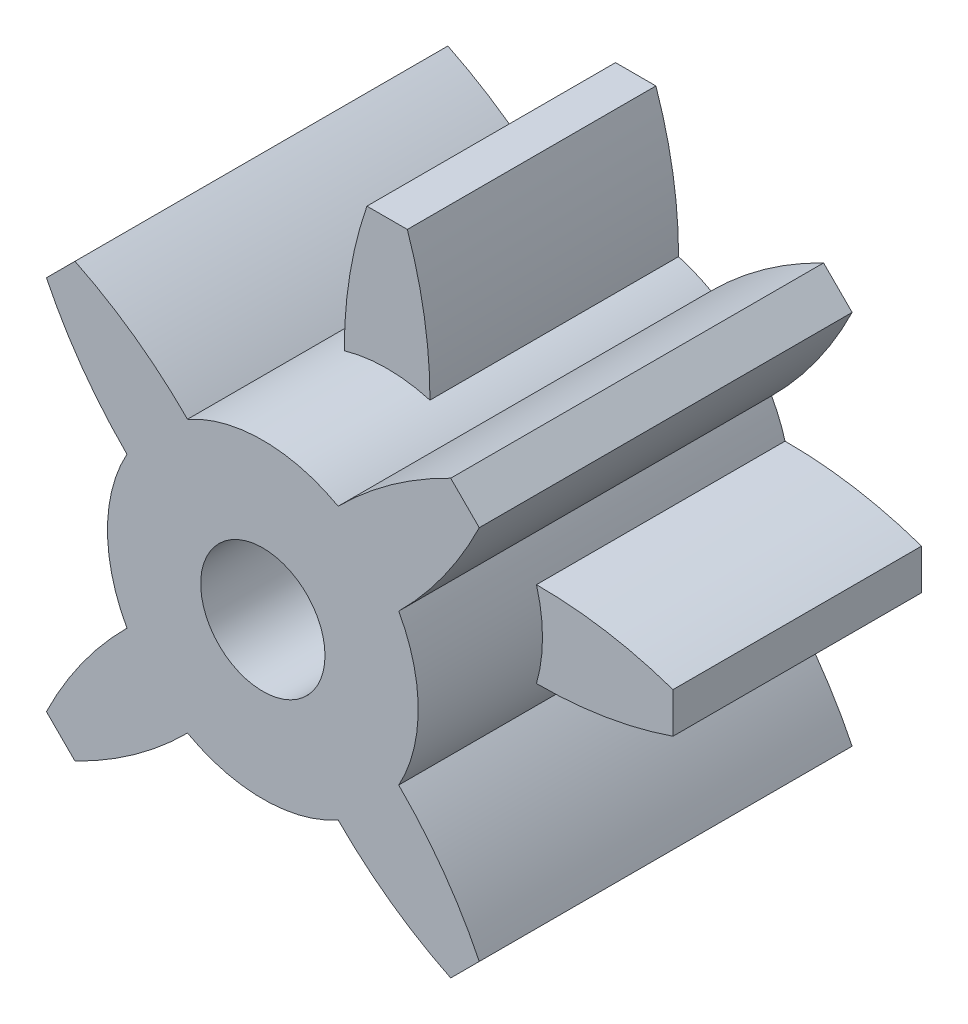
ISO-10303-21;
HEADER;
FILE_DESCRIPTION(('STEP AP214'),'2;1');
FILE_NAME('part.step','',(''),(''),'','','');
FILE_SCHEMA(('AUTOMOTIVE_DESIGN { 1 0 10303 214 1 1 1 1 }'));
ENDSEC;
DATA;
#1=APPLICATION_CONTEXT('core data for automotive mechanical design processes');
#2=APPLICATION_PROTOCOL_DEFINITION('international standard','automotive_design',2000,#1);
#3=PRODUCT_CONTEXT('',#1,'mechanical');
#4=PRODUCT('Part','Part','',(#3));
#5=PRODUCT_RELATED_PRODUCT_CATEGORY('part','',(#4));
#6=PRODUCT_DEFINITION_FORMATION('','',#4);
#7=PRODUCT_DEFINITION_CONTEXT('part definition',#1,'design');
#8=PRODUCT_DEFINITION('design','',#6,#7);
#9=PRODUCT_DEFINITION_SHAPE('','',#8);
#10=(LENGTH_UNIT() NAMED_UNIT(*) SI_UNIT(.MILLI.,.METRE.));
#11=(NAMED_UNIT(*) PLANE_ANGLE_UNIT() SI_UNIT($,.RADIAN.));
#12=(NAMED_UNIT(*) SI_UNIT($,.STERADIAN.) SOLID_ANGLE_UNIT());
#13=UNCERTAINTY_MEASURE_WITH_UNIT(LENGTH_MEASURE(1.E-05),#10,'distance_accuracy_value','');
#14=(GEOMETRIC_REPRESENTATION_CONTEXT(3) GLOBAL_UNCERTAINTY_ASSIGNED_CONTEXT((#13)) GLOBAL_UNIT_ASSIGNED_CONTEXT((#10,
#11,#12)) REPRESENTATION_CONTEXT('',''));
#15=CARTESIAN_POINT('',(0.,0.,0.));
#16=DIRECTION('',(0.,0.,1.));
#17=DIRECTION('',(1.,0.,0.));
#18=AXIS2_PLACEMENT_3D('',#15,#16,#17);
#19=CARTESIAN_POINT('',(-29.8672178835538,75.1376777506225,30.));
#20=DIRECTION('',(0.,0.,-1.));
#21=DIRECTION('',(-1.,0.,0.));
#22=AXIS2_PLACEMENT_3D('',#19,#20,#21);
#23=CYLINDRICAL_SURFACE('',#22,33.3129078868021);
#24=CARTESIAN_POINT('',(-29.8672178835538,75.1376777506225,20.));
#25=DIRECTION('',(0.,0.,1.));
#26=DIRECTION('',(1.,0.,0.));
#27=AXIS2_PLACEMENT_3D('',#24,#25,#26);
#28=CIRCLE('',#27,33.3129078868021);
#29=CARTESIAN_POINT('',(3.44546694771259,75.0157711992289,20.));
#30=VERTEX_POINT('',#29);
#31=CARTESIAN_POINT('',(1.62500000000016,86.,20.));
#32=VERTEX_POINT('',#31);
#33=EDGE_CURVE('E445',#30,#32,#28,.T.);
#34=ORIENTED_EDGE('',*,*,#33,.F.);
#35=DIRECTION('',(0.,0.,-1.));
#36=VECTOR('',#35,1.);
#37=CARTESIAN_POINT('',(3.44546694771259,75.015771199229,30.));
#38=LINE('',#37,#36);
#39=CARTESIAN_POINT('',(3.44546694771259,75.015771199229,0.));
#40=VERTEX_POINT('',#39);
#41=EDGE_CURVE('E376',#30,#40,#38,.T.);
#42=ORIENTED_EDGE('',*,*,#41,.T.);
#43=CARTESIAN_POINT('',(-29.8672178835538,75.1376777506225,0.));
#44=DIRECTION('',(0.,0.,1.));
#45=DIRECTION('',(1.,0.,0.));
#46=AXIS2_PLACEMENT_3D('',#43,#44,#45);
#47=CIRCLE('',#46,33.3129078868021);
#48=CARTESIAN_POINT('',(1.62500000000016,86.,0.));
#49=VERTEX_POINT('',#48);
#50=EDGE_CURVE('E261',#40,#49,#47,.T.);
#51=ORIENTED_EDGE('',*,*,#50,.T.);
#52=DIRECTION('',(0.,0.,-1.));
#53=VECTOR('',#52,1.);
#54=CARTESIAN_POINT('',(1.62500000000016,86.,30.));
#55=LINE('',#54,#53);
#56=EDGE_CURVE('E374',#32,#49,#55,.T.);
#57=ORIENTED_EDGE('',*,*,#56,.F.);
#58=EDGE_LOOP('',(#34,#42,#51,#57));
#59=FACE_BOUND('',#58,.T.);
#60=ADVANCED_FACE('F38',(#59),#23,.T.);
#61=CARTESIAN_POINT('',(7.34455231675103E-13,86.,30.));
#62=DIRECTION('',(0.,-1.,0.));
#63=DIRECTION('',(1.,0.,0.));
#64=AXIS2_PLACEMENT_3D('',#61,#62,#63);
#65=PLANE('',#64);
#66=DIRECTION('',(-1.,0.,0.));
#67=VECTOR('',#66,1.);
#68=CARTESIAN_POINT('',(7.34455231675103E-13,86.,20.));
#69=LINE('',#68,#67);
#70=CARTESIAN_POINT('',(-1.62499999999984,86.,20.));
#71=VERTEX_POINT('',#70);
#72=EDGE_CURVE('E442',#32,#71,#69,.T.);
#73=ORIENTED_EDGE('',*,*,#72,.F.);
#74=ORIENTED_EDGE('',*,*,#56,.T.);
#75=DIRECTION('',(-1.,0.,0.));
#76=VECTOR('',#75,1.);
#77=CARTESIAN_POINT('',(7.34455231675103E-13,86.,0.));
#78=LINE('',#77,#76);
#79=CARTESIAN_POINT('',(-1.62499999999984,86.,0.));
#80=VERTEX_POINT('',#79);
#81=EDGE_CURVE('E264',#49,#80,#78,.T.);
#82=ORIENTED_EDGE('',*,*,#81,.T.);
#83=DIRECTION('',(0.,0.,-1.));
#84=VECTOR('',#83,1.);
#85=CARTESIAN_POINT('',(-1.62499999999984,86.,30.));
#86=LINE('',#85,#84);
#87=EDGE_CURVE('E372',#71,#80,#86,.T.);
#88=ORIENTED_EDGE('',*,*,#87,.F.);
#89=EDGE_LOOP('',(#73,#74,#82,#88));
#90=FACE_BOUND('',#89,.T.);
#91=ADVANCED_FACE('F564',(#90),#65,.F.);
#92=CARTESIAN_POINT('',(29.867217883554,75.137677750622,30.));
#93=DIRECTION('',(0.,0.,-1.));
#94=DIRECTION('',(-1.,0.,0.));
#95=AXIS2_PLACEMENT_3D('',#92,#93,#94);
#96=CYLINDRICAL_SURFACE('',#95,33.3129078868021);
#97=DIRECTION('',(0.,0.,-1.));
#98=VECTOR('',#97,1.);
#99=CARTESIAN_POINT('',(-3.44546694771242,75.015771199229,30.));
#100=LINE('',#99,#98);
#101=CARTESIAN_POINT('',(-3.44546694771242,75.015771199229,20.));
#102=VERTEX_POINT('',#101);
#103=CARTESIAN_POINT('',(-3.44546694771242,75.015771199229,0.));
#104=VERTEX_POINT('',#103);
#105=EDGE_CURVE('E370',#102,#104,#100,.T.);
#106=ORIENTED_EDGE('',*,*,#105,.F.);
#107=CARTESIAN_POINT('',(29.867217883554,75.137677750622,20.));
#108=DIRECTION('',(0.,0.,1.));
#109=DIRECTION('',(1.,0.,0.));
#110=AXIS2_PLACEMENT_3D('',#107,#108,#109);
#111=CIRCLE('',#110,33.3129078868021);
#112=EDGE_CURVE('E438',#71,#102,#111,.T.);
#113=ORIENTED_EDGE('',*,*,#112,.F.);
#114=ORIENTED_EDGE('',*,*,#87,.T.);
#115=CARTESIAN_POINT('',(29.867217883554,75.137677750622,0.));
#116=DIRECTION('',(0.,0.,1.));
#117=DIRECTION('',(1.,0.,0.));
#118=AXIS2_PLACEMENT_3D('',#115,#116,#117);
#119=CIRCLE('',#118,33.3129078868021);
#120=EDGE_CURVE('E267',#104,#80,#119,.F.);
#121=ORIENTED_EDGE('',*,*,#120,.F.);
#122=EDGE_LOOP('',(#106,#113,#114,#121));
#123=FACE_BOUND('',#122,.T.);
#124=ADVANCED_FACE('F570',(#123),#96,.T.);
#125=CARTESIAN_POINT('',(-12.1376777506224,33.1327821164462,30.));
#126=DIRECTION('',(0.,0.,-1.));
#127=DIRECTION('',(-1.,0.,0.));
#128=AXIS2_PLACEMENT_3D('',#125,#126,#127);
#129=CYLINDRICAL_SURFACE('',#128,33.3129078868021);
#130=CARTESIAN_POINT('',(-12.1376777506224,33.1327821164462,20.));
#131=DIRECTION('',(0.,0.,1.));
#132=DIRECTION('',(1.,0.,0.));
#133=AXIS2_PLACEMENT_3D('',#130,#131,#132);
#134=CIRCLE('',#133,33.3129078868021);
#135=CARTESIAN_POINT('',(-12.015771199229,66.4454669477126,20.));
#136=VERTEX_POINT('',#135);
#137=CARTESIAN_POINT('',(-23.,64.6250000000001,20.));
#138=VERTEX_POINT('',#137);
#139=EDGE_CURVE('E466',#136,#138,#134,.T.);
#140=ORIENTED_EDGE('',*,*,#139,.F.);
#141=DIRECTION('',(0.,0.,-1.));
#142=VECTOR('',#141,1.);
#143=CARTESIAN_POINT('',(-12.015771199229,66.4454669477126,30.));
#144=LINE('',#143,#142);
#145=CARTESIAN_POINT('',(-12.015771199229,66.4454669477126,0.));
#146=VERTEX_POINT('',#145);
#147=EDGE_CURVE('E358',#136,#146,#144,.T.);
#148=ORIENTED_EDGE('',*,*,#147,.T.);
#149=CARTESIAN_POINT('',(-12.1376777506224,33.1327821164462,0.));
#150=DIRECTION('',(0.,0.,1.));
#151=DIRECTION('',(1.,0.,0.));
#152=AXIS2_PLACEMENT_3D('',#149,#150,#151);
#153=CIRCLE('',#152,33.3129078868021);
#154=CARTESIAN_POINT('',(-23.,64.6250000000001,0.));
#155=VERTEX_POINT('',#154);
#156=EDGE_CURVE('E280',#146,#155,#153,.T.);
#157=ORIENTED_EDGE('',*,*,#156,.T.);
#158=DIRECTION('',(0.,0.,-1.));
#159=VECTOR('',#158,1.);
#160=CARTESIAN_POINT('',(-23.,64.6250000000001,30.));
#161=LINE('',#160,#159);
#162=EDGE_CURVE('E356',#138,#155,#161,.T.);
#163=ORIENTED_EDGE('',*,*,#162,.F.);
#164=EDGE_LOOP('',(#140,#148,#157,#163));
#165=FACE_BOUND('',#164,.T.);
#166=ADVANCED_FACE('F628',(#165),#129,.T.);
#167=CARTESIAN_POINT('',(-23.0000000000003,0.,30.));
#168=DIRECTION('',(1.,0.,0.));
#169=DIRECTION('',(0.,1.,0.));
#170=AXIS2_PLACEMENT_3D('',#167,#168,#169);
#171=PLANE('',#170);
#172=DIRECTION('',(0.,-1.,0.));
#173=VECTOR('',#172,1.);
#174=CARTESIAN_POINT('',(-23.0000000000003,0.,20.));
#175=LINE('',#174,#173);
#176=CARTESIAN_POINT('',(-23.,61.3750000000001,20.));
#177=VERTEX_POINT('',#176);
#178=EDGE_CURVE('E463',#138,#177,#175,.T.);
#179=ORIENTED_EDGE('',*,*,#178,.F.);
#180=ORIENTED_EDGE('',*,*,#162,.T.);
#181=DIRECTION('',(0.,-1.,0.));
#182=VECTOR('',#181,1.);
#183=CARTESIAN_POINT('',(-23.0000000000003,0.,0.));
#184=LINE('',#183,#182);
#185=CARTESIAN_POINT('',(-23.,61.3750000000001,0.));
#186=VERTEX_POINT('',#185);
#187=EDGE_CURVE('E283',#155,#186,#184,.T.);
#188=ORIENTED_EDGE('',*,*,#187,.T.);
#189=DIRECTION('',(0.,0.,-1.));
#190=VECTOR('',#189,1.);
#191=CARTESIAN_POINT('',(-23.,61.3750000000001,30.));
#192=LINE('',#191,#190);
#193=EDGE_CURVE('E354',#177,#186,#192,.T.);
#194=ORIENTED_EDGE('',*,*,#193,.F.);
#195=EDGE_LOOP('',(#179,#180,#188,#194));
#196=FACE_BOUND('',#195,.T.);
#197=ADVANCED_FACE('F625',(#196),#171,.F.);
#198=CARTESIAN_POINT('',(-12.1376777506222,92.8672178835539,30.));
#199=DIRECTION('',(0.,0.,-1.));
#200=DIRECTION('',(-1.,0.,0.));
#201=AXIS2_PLACEMENT_3D('',#198,#199,#200);
#202=CYLINDRICAL_SURFACE('',#201,33.312907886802);
#203=DIRECTION('',(0.,0.,-1.));
#204=VECTOR('',#203,1.);
#205=CARTESIAN_POINT('',(-12.015771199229,59.5545330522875,30.));
#206=LINE('',#205,#204);
#207=CARTESIAN_POINT('',(-12.015771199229,59.5545330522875,20.));
#208=VERTEX_POINT('',#207);
#209=CARTESIAN_POINT('',(-12.015771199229,59.5545330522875,0.));
#210=VERTEX_POINT('',#209);
#211=EDGE_CURVE('E352',#208,#210,#206,.T.);
#212=ORIENTED_EDGE('',*,*,#211,.F.);
#213=CARTESIAN_POINT('',(-12.1376777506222,92.8672178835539,20.));
#214=DIRECTION('',(0.,0.,1.));
#215=DIRECTION('',(1.,0.,0.));
#216=AXIS2_PLACEMENT_3D('',#213,#214,#215);
#217=CIRCLE('',#216,33.312907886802);
#218=EDGE_CURVE('E249',#177,#208,#217,.T.);
#219=ORIENTED_EDGE('',*,*,#218,.F.);
#220=ORIENTED_EDGE('',*,*,#193,.T.);
#221=CARTESIAN_POINT('',(-12.1376777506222,92.8672178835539,0.));
#222=DIRECTION('',(0.,0.,1.));
#223=DIRECTION('',(1.,0.,0.));
#224=AXIS2_PLACEMENT_3D('',#221,#222,#223);
#225=CIRCLE('',#224,33.312907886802);
#226=EDGE_CURVE('E286',#210,#186,#225,.F.);
#227=ORIENTED_EDGE('',*,*,#226,.F.);
#228=EDGE_LOOP('',(#212,#219,#220,#227));
#229=FACE_BOUND('',#228,.T.);
#230=ADVANCED_FACE('F488',(#229),#202,.T.);
#231=CARTESIAN_POINT('',(29.8672178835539,50.8623222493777,30.));
#232=DIRECTION('',(0.,0.,-1.));
#233=DIRECTION('',(-1.,0.,0.));
#234=AXIS2_PLACEMENT_3D('',#231,#232,#233);
#235=CYLINDRICAL_SURFACE('',#234,33.3129078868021);
#236=CARTESIAN_POINT('',(29.8672178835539,50.8623222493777,20.));
#237=DIRECTION('',(0.,0.,1.));
#238=DIRECTION('',(1.,0.,0.));
#239=AXIS2_PLACEMENT_3D('',#236,#237,#238);
#240=CIRCLE('',#239,33.3129078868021);
#241=CARTESIAN_POINT('',(-3.4454669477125,50.984228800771,20.));
#242=VERTEX_POINT('',#241);
#243=CARTESIAN_POINT('',(-1.625,40.,20.));
#244=VERTEX_POINT('',#243);
#245=EDGE_CURVE('E432',#242,#244,#240,.T.);
#246=ORIENTED_EDGE('',*,*,#245,.F.);
#247=DIRECTION('',(0.,0.,-1.));
#248=VECTOR('',#247,1.);
#249=CARTESIAN_POINT('',(-3.44546694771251,50.984228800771,30.));
#250=LINE('',#249,#248);
#251=CARTESIAN_POINT('',(-3.44546694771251,50.984228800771,0.));
#252=VERTEX_POINT('',#251);
#253=EDGE_CURVE('E340',#242,#252,#250,.T.);
#254=ORIENTED_EDGE('',*,*,#253,.T.);
#255=CARTESIAN_POINT('',(29.8672178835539,50.8623222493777,0.));
#256=DIRECTION('',(0.,0.,1.));
#257=DIRECTION('',(1.,0.,0.));
#258=AXIS2_PLACEMENT_3D('',#255,#256,#257);
#259=CIRCLE('',#258,33.3129078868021);
#260=CARTESIAN_POINT('',(-1.625,40.,0.));
#261=VERTEX_POINT('',#260);
#262=EDGE_CURVE('E299',#252,#261,#259,.T.);
#263=ORIENTED_EDGE('',*,*,#262,.T.);
#264=DIRECTION('',(0.,0.,-1.));
#265=VECTOR('',#264,1.);
#266=CARTESIAN_POINT('',(-1.625,40.,30.));
#267=LINE('',#266,#265);
#268=EDGE_CURVE('E338',#244,#261,#267,.T.);
#269=ORIENTED_EDGE('',*,*,#268,.F.);
#270=EDGE_LOOP('',(#246,#254,#263,#269));
#271=FACE_BOUND('',#270,.T.);
#272=ADVANCED_FACE('F604',(#271),#235,.T.);
#273=CARTESIAN_POINT('',(0.,40.,30.));
#274=DIRECTION('',(0.,1.,0.));
#275=DIRECTION('',(0.,0.,1.));
#276=AXIS2_PLACEMENT_3D('',#273,#274,#275);
#277=PLANE('',#276);
#278=DIRECTION('',(1.,0.,0.));
#279=VECTOR('',#278,1.);
#280=CARTESIAN_POINT('',(0.,40.,20.));
#281=LINE('',#280,#279);
#282=CARTESIAN_POINT('',(1.62500000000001,40.,20.));
#283=VERTEX_POINT('',#282);
#284=EDGE_CURVE('E429',#244,#283,#281,.T.);
#285=ORIENTED_EDGE('',*,*,#284,.F.);
#286=ORIENTED_EDGE('',*,*,#268,.T.);
#287=DIRECTION('',(1.,0.,0.));
#288=VECTOR('',#287,1.);
#289=CARTESIAN_POINT('',(0.,40.,0.));
#290=LINE('',#289,#288);
#291=CARTESIAN_POINT('',(1.625,40.,0.));
#292=VERTEX_POINT('',#291);
#293=EDGE_CURVE('E302',#261,#292,#290,.T.);
#294=ORIENTED_EDGE('',*,*,#293,.T.);
#295=DIRECTION('',(0.,0.,-1.));
#296=VECTOR('',#295,1.);
#297=CARTESIAN_POINT('',(1.625,40.,30.));
#298=LINE('',#297,#296);
#299=EDGE_CURVE('E336',#283,#292,#298,.T.);
#300=ORIENTED_EDGE('',*,*,#299,.F.);
#301=EDGE_LOOP('',(#285,#286,#294,#300));
#302=FACE_BOUND('',#301,.T.);
#303=ADVANCED_FACE('F599',(#302),#277,.F.);
#304=CARTESIAN_POINT('',(-29.8672178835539,50.8623222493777,30.));
#305=DIRECTION('',(0.,0.,-1.));
#306=DIRECTION('',(-1.,0.,0.));
#307=AXIS2_PLACEMENT_3D('',#304,#305,#306);
#308=CYLINDRICAL_SURFACE('',#307,33.3129078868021);
#309=DIRECTION('',(0.,0.,-1.));
#310=VECTOR('',#309,1.);
#311=CARTESIAN_POINT('',(3.44546694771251,50.984228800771,30.));
#312=LINE('',#311,#310);
#313=CARTESIAN_POINT('',(3.4454669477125,50.984228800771,20.));
#314=VERTEX_POINT('',#313);
#315=CARTESIAN_POINT('',(3.44546694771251,50.984228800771,0.));
#316=VERTEX_POINT('',#315);
#317=EDGE_CURVE('E334',#314,#316,#312,.T.);
#318=ORIENTED_EDGE('',*,*,#317,.F.);
#319=CARTESIAN_POINT('',(-29.8672178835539,50.8623222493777,20.));
#320=DIRECTION('',(0.,0.,1.));
#321=DIRECTION('',(1.,0.,0.));
#322=AXIS2_PLACEMENT_3D('',#319,#320,#321);
#323=CIRCLE('',#322,33.3129078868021);
#324=EDGE_CURVE('E425',#283,#314,#323,.T.);
#325=ORIENTED_EDGE('',*,*,#324,.F.);
#326=ORIENTED_EDGE('',*,*,#299,.T.);
#327=CARTESIAN_POINT('',(-29.8672178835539,50.8623222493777,0.));
#328=DIRECTION('',(0.,0.,1.));
#329=DIRECTION('',(1.,0.,0.));
#330=AXIS2_PLACEMENT_3D('',#327,#328,#329);
#331=CIRCLE('',#330,33.3129078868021);
#332=EDGE_CURVE('E305',#316,#292,#331,.F.);
#333=ORIENTED_EDGE('',*,*,#332,.F.);
#334=EDGE_LOOP('',(#318,#325,#326,#333));
#335=FACE_BOUND('',#334,.T.);
#336=ADVANCED_FACE('F550',(#335),#308,.T.);
#337=CARTESIAN_POINT('',(12.1376777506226,92.8672178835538,30.));
#338=DIRECTION('',(0.,0.,-1.));
#339=DIRECTION('',(-1.,0.,0.));
#340=AXIS2_PLACEMENT_3D('',#337,#338,#339);
#341=CYLINDRICAL_SURFACE('',#340,33.3129078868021);
#342=CARTESIAN_POINT('',(12.1376777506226,92.8672178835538,20.));
#343=DIRECTION('',(0.,0.,1.));
#344=DIRECTION('',(1.,0.,0.));
#345=AXIS2_PLACEMENT_3D('',#342,#343,#344);
#346=CIRCLE('',#345,33.3129078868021);
#347=CARTESIAN_POINT('',(12.0157711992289,59.5545330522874,20.));
#348=VERTEX_POINT('',#347);
#349=CARTESIAN_POINT('',(23.,61.3749999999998,20.));
#350=VERTEX_POINT('',#349);
#351=EDGE_CURVE('E457',#348,#350,#346,.T.);
#352=ORIENTED_EDGE('',*,*,#351,.F.);
#353=DIRECTION('',(0.,0.,-1.));
#354=VECTOR('',#353,1.);
#355=CARTESIAN_POINT('',(12.0157711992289,59.5545330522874,30.));
#356=LINE('',#355,#354);
#357=CARTESIAN_POINT('',(12.0157711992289,59.5545330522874,0.));
#358=VERTEX_POINT('',#357);
#359=EDGE_CURVE('E328',#348,#358,#356,.T.);
#360=ORIENTED_EDGE('',*,*,#359,.T.);
#361=CARTESIAN_POINT('',(12.1376777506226,92.8672178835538,0.));
#362=DIRECTION('',(0.,0.,1.));
#363=DIRECTION('',(1.,0.,0.));
#364=AXIS2_PLACEMENT_3D('',#361,#362,#363);
#365=CIRCLE('',#364,33.3129078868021);
#366=CARTESIAN_POINT('',(23.,61.3749999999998,0.));
#367=VERTEX_POINT('',#366);
#368=EDGE_CURVE('E315',#358,#367,#365,.T.);
#369=ORIENTED_EDGE('',*,*,#368,.T.);
#370=DIRECTION('',(0.,0.,-1.));
#371=VECTOR('',#370,1.);
#372=CARTESIAN_POINT('',(23.,61.3749999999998,30.));
#373=LINE('',#372,#371);
#374=EDGE_CURVE('E326',#350,#367,#373,.T.);
#375=ORIENTED_EDGE('',*,*,#374,.F.);
#376=EDGE_LOOP('',(#352,#360,#369,#375));
#377=FACE_BOUND('',#376,.T.);
#378=ADVANCED_FACE('F511',(#377),#341,.T.);
#379=CARTESIAN_POINT('',(22.9999999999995,-1.96424073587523E-13,30.));
#380=DIRECTION('',(-1.,0.,0.));
#381=DIRECTION('',(0.,-1.,0.));
#382=AXIS2_PLACEMENT_3D('',#379,#380,#381);
#383=PLANE('',#382);
#384=DIRECTION('',(0.,1.,0.));
#385=VECTOR('',#384,1.);
#386=CARTESIAN_POINT('',(22.9999999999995,-1.96424073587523E-13,20.));
#387=LINE('',#386,#385);
#388=CARTESIAN_POINT('',(23.,64.6249999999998,20.));
#389=VERTEX_POINT('',#388);
#390=EDGE_CURVE('E454',#350,#389,#387,.T.);
#391=ORIENTED_EDGE('',*,*,#390,.F.);
#392=ORIENTED_EDGE('',*,*,#374,.T.);
#393=DIRECTION('',(0.,1.,0.));
#394=VECTOR('',#393,1.);
#395=CARTESIAN_POINT('',(22.9999999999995,-1.96424073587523E-13,0.));
#396=LINE('',#395,#394);
#397=CARTESIAN_POINT('',(23.,64.6249999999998,0.));
#398=VERTEX_POINT('',#397);
#399=EDGE_CURVE('E318',#367,#398,#396,.T.);
#400=ORIENTED_EDGE('',*,*,#399,.T.);
#401=DIRECTION('',(0.,0.,-1.));
#402=VECTOR('',#401,1.);
#403=CARTESIAN_POINT('',(23.,64.6249999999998,30.));
#404=LINE('',#403,#402);
#405=EDGE_CURVE('E157',#389,#398,#404,.T.);
#406=ORIENTED_EDGE('',*,*,#405,.F.);
#407=EDGE_LOOP('',(#391,#392,#400,#406));
#408=FACE_BOUND('',#407,.T.);
#409=ADVANCED_FACE('F522',(#408),#383,.F.);
#410=CARTESIAN_POINT('',(12.1376777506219,33.132782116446,30.));
#411=DIRECTION('',(0.,0.,-1.));
#412=DIRECTION('',(-1.,0.,0.));
#413=AXIS2_PLACEMENT_3D('',#410,#411,#412);
#414=CYLINDRICAL_SURFACE('',#413,33.312907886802);
#415=DIRECTION('',(0.,0.,-1.));
#416=VECTOR('',#415,1.);
#417=CARTESIAN_POINT('',(12.015771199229,66.4454669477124,30.));
#418=LINE('',#417,#416);
#419=CARTESIAN_POINT('',(12.015771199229,66.4454669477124,20.));
#420=VERTEX_POINT('',#419);
#421=CARTESIAN_POINT('',(12.015771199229,66.4454669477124,0.));
#422=VERTEX_POINT('',#421);
#423=EDGE_CURVE('E164',#420,#422,#418,.T.);
#424=ORIENTED_EDGE('',*,*,#423,.F.);
#425=CARTESIAN_POINT('',(12.1376777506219,33.132782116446,20.));
#426=DIRECTION('',(0.,0.,1.));
#427=DIRECTION('',(1.,0.,0.));
#428=AXIS2_PLACEMENT_3D('',#425,#426,#427);
#429=CIRCLE('',#428,33.312907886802);
#430=EDGE_CURVE('E450',#389,#420,#429,.T.);
#431=ORIENTED_EDGE('',*,*,#430,.F.);
#432=ORIENTED_EDGE('',*,*,#405,.T.);
#433=CARTESIAN_POINT('',(12.1376777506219,33.132782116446,0.));
#434=DIRECTION('',(0.,0.,1.));
#435=DIRECTION('',(1.,0.,0.));
#436=AXIS2_PLACEMENT_3D('',#433,#434,#435);
#437=CIRCLE('',#436,33.312907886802);
#438=EDGE_CURVE('E320',#422,#398,#437,.F.);
#439=ORIENTED_EDGE('',*,*,#438,.F.);
#440=EDGE_LOOP('',(#424,#431,#432,#439));
#441=FACE_BOUND('',#440,.T.);
#442=ADVANCED_FACE('F584',(#441),#414,.T.);
#443=CARTESIAN_POINT('',(0.,0.,30.));
#444=DIRECTION('',(0.,0.,1.));
#445=DIRECTION('',(1.,0.,0.));
#446=AXIS2_PLACEMENT_3D('',#443,#444,#445);
#447=PLANE('',#446);
#448=CARTESIAN_POINT('',(0.,63.,30.));
#449=DIRECTION('',(0.,0.,1.));
#450=DIRECTION('',(1.,0.,0.));
#451=AXIS2_PLACEMENT_3D('',#448,#449,#450);
#452=CIRCLE('',#451,5.);
#453=CARTESIAN_POINT('',(5.,63.,30.));
#454=VERTEX_POINT('',#453);
#455=EDGE_CURVE('E323',#454,#454,#452,.T.);
#456=ORIENTED_EDGE('',*,*,#455,.F.);
#457=EDGE_LOOP('',(#456));
#458=FACE_BOUND('',#457,.T.);
#459=CARTESIAN_POINT('',(0.,63.,30.));
#460=DIRECTION('',(0.,0.,1.));
#461=DIRECTION('',(1.,0.,0.));
#462=AXIS2_PLACEMENT_3D('',#459,#460,#461);
#463=CIRCLE('',#462,12.5);
#464=CARTESIAN_POINT('',(-10.9327463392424,69.0601202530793,30.));
#465=VERTEX_POINT('',#464);
#466=CARTESIAN_POINT('',(-10.9327463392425,56.9398797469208,30.));
#467=VERTEX_POINT('',#466);
#468=EDGE_CURVE('E404',#465,#467,#463,.T.);
#469=ORIENTED_EDGE('',*,*,#468,.T.);
#470=CARTESIAN_POINT('',(12.5366780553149,33.2980534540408,30.));
#471=DIRECTION('',(0.,0.,1.));
#472=DIRECTION('',(1.,0.,0.));
#473=AXIS2_PLACEMENT_3D('',#470,#471,#472);
#474=CIRCLE('',#473,33.312907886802);
#475=CARTESIAN_POINT('',(-17.4125044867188,47.8855925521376,30.));
#476=VERTEX_POINT('',#475);
#477=EDGE_CURVE('E414',#467,#476,#474,.T.);
#478=ORIENTED_EDGE('',*,*,#477,.T.);
#479=DIRECTION('',(0.707106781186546,-0.707106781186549,0.));
#480=VECTOR('',#479,1.);
#481=CARTESIAN_POINT('',(15.2365440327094,15.2365440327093,30.));
#482=LINE('',#481,#480);
#483=CARTESIAN_POINT('',(-15.1144074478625,45.5874955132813,30.));
#484=VERTEX_POINT('',#483);
#485=EDGE_CURVE('E416',#476,#484,#482,.T.);
#486=ORIENTED_EDGE('',*,*,#485,.T.);
#487=CARTESIAN_POINT('',(-29.7019465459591,75.5366780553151,30.));
#488=DIRECTION('',(0.,0.,1.));
#489=DIRECTION('',(1.,0.,0.));
#490=AXIS2_PLACEMENT_3D('',#487,#488,#489);
#491=CIRCLE('',#490,33.3129078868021);
#492=CARTESIAN_POINT('',(-6.06012025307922,52.0672536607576,30.));
#493=VERTEX_POINT('',#492);
#494=EDGE_CURVE('E417',#493,#484,#491,.F.);
#495=ORIENTED_EDGE('',*,*,#494,.F.);
#496=CARTESIAN_POINT('',(6.06012025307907,52.0672536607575,30.));
#497=VERTEX_POINT('',#496);
#498=EDGE_CURVE('E222',#493,#497,#463,.T.);
#499=ORIENTED_EDGE('',*,*,#498,.T.);
#500=CARTESIAN_POINT('',(29.7019465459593,75.5366780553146,30.));
#501=DIRECTION('',(0.,0.,1.));
#502=DIRECTION('',(1.,0.,0.));
#503=AXIS2_PLACEMENT_3D('',#500,#501,#502);
#504=CIRCLE('',#503,33.312907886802);
#505=CARTESIAN_POINT('',(15.1144074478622,45.5874955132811,30.));
#506=VERTEX_POINT('',#505);
#507=EDGE_CURVE('E213',#497,#506,#504,.T.);
#508=ORIENTED_EDGE('',*,*,#507,.T.);
#509=DIRECTION('',(0.707106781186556,0.707106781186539,0.));
#510=VECTOR('',#509,1.);
#511=CARTESIAN_POINT('',(-15.2365440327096,15.23654403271,30.));
#512=LINE('',#511,#510);
#513=CARTESIAN_POINT('',(17.4125044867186,47.8855925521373,30.));
#514=VERTEX_POINT('',#513);
#515=EDGE_CURVE('E218',#506,#514,#512,.T.);
#516=ORIENTED_EDGE('',*,*,#515,.T.);
#517=CARTESIAN_POINT('',(-12.5366780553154,33.298053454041,30.));
#518=DIRECTION('',(0.,0.,1.));
#519=DIRECTION('',(1.,0.,0.));
#520=AXIS2_PLACEMENT_3D('',#517,#518,#519);
#521=CIRCLE('',#520,33.312907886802);
#522=CARTESIAN_POINT('',(10.9327463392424,56.9398797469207,30.));
#523=VERTEX_POINT('',#522);
#524=EDGE_CURVE('E240',#523,#514,#521,.F.);
#525=ORIENTED_EDGE('',*,*,#524,.F.);
#526=CARTESIAN_POINT('',(10.9327463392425,69.0601202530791,30.));
#527=VERTEX_POINT('',#526);
#528=EDGE_CURVE('E55',#523,#527,#463,.T.);
#529=ORIENTED_EDGE('',*,*,#528,.T.);
#530=CARTESIAN_POINT('',(-12.5366780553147,92.7019465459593,30.));
#531=DIRECTION('',(0.,0.,1.));
#532=DIRECTION('',(1.,0.,0.));
#533=AXIS2_PLACEMENT_3D('',#530,#531,#532);
#534=CIRCLE('',#533,33.312907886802);
#535=CARTESIAN_POINT('',(17.4125044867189,78.1144074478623,30.));
#536=VERTEX_POINT('',#535);
#537=EDGE_CURVE('E172',#527,#536,#534,.T.);
#538=ORIENTED_EDGE('',*,*,#537,.T.);
#539=DIRECTION('',(-0.707106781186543,0.707106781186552,0.));
#540=VECTOR('',#539,1.);
#541=CARTESIAN_POINT('',(47.7634559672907,47.7634559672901,30.));
#542=LINE('',#541,#540);
#543=CARTESIAN_POINT('',(15.1144074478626,80.4125044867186,30.));
#544=VERTEX_POINT('',#543);
#545=EDGE_CURVE('E387',#536,#544,#542,.T.);
#546=ORIENTED_EDGE('',*,*,#545,.T.);
#547=CARTESIAN_POINT('',(29.7019465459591,50.4633219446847,30.));
#548=DIRECTION('',(0.,0.,1.));
#549=DIRECTION('',(1.,0.,0.));
#550=AXIS2_PLACEMENT_3D('',#547,#548,#549);
#551=CIRCLE('',#550,33.3129078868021);
#552=CARTESIAN_POINT('',(6.0601202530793,73.9327463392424,30.));
#553=VERTEX_POINT('',#552);
#554=EDGE_CURVE('E399',#553,#544,#551,.F.);
#555=ORIENTED_EDGE('',*,*,#554,.F.);
#556=CARTESIAN_POINT('',(-6.06012025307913,73.9327463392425,30.));
#557=VERTEX_POINT('',#556);
#558=EDGE_CURVE('E400',#553,#557,#463,.T.);
#559=ORIENTED_EDGE('',*,*,#558,.T.);
#560=CARTESIAN_POINT('',(-29.7019465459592,50.4633219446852,30.));
#561=DIRECTION('',(0.,0.,1.));
#562=DIRECTION('',(1.,0.,0.));
#563=AXIS2_PLACEMENT_3D('',#560,#561,#562);
#564=CIRCLE('',#563,33.3129078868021);
#565=CARTESIAN_POINT('',(-15.1144074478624,80.4125044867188,30.));
#566=VERTEX_POINT('',#565);
#567=EDGE_CURVE('E402',#557,#566,#564,.T.);
#568=ORIENTED_EDGE('',*,*,#567,.T.);
#569=DIRECTION('',(-0.70710678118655,-0.707106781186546,0.));
#570=VECTOR('',#569,1.);
#571=CARTESIAN_POINT('',(-47.7634559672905,47.7634559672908,30.));
#572=LINE('',#571,#570);
#573=CARTESIAN_POINT('',(-17.4125044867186,78.1144074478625,30.));
#574=VERTEX_POINT('',#573);
#575=EDGE_CURVE('E409',#566,#574,#572,.T.);
#576=ORIENTED_EDGE('',*,*,#575,.T.);
#577=CARTESIAN_POINT('',(12.5366780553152,92.7019465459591,30.));
#578=DIRECTION('',(0.,0.,1.));
#579=DIRECTION('',(1.,0.,0.));
#580=AXIS2_PLACEMENT_3D('',#577,#578,#579);
#581=CIRCLE('',#580,33.3129078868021);
#582=EDGE_CURVE('E411',#465,#574,#581,.F.);
#583=ORIENTED_EDGE('',*,*,#582,.F.);
#584=EDGE_LOOP('',(#469,#478,#486,#495,#499,#508,#516,#525,#529,#538,#546,#555,#559,#568,#576,#583));
#585=FACE_BOUND('',#584,.T.);
#586=ADVANCED_FACE('F215',(#458,#585),#447,.T.);
#587=CARTESIAN_POINT('',(-12.5366780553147,92.7019465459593,30.));
#588=DIRECTION('',(0.,0.,-1.));
#589=DIRECTION('',(-1.,0.,0.));
#590=AXIS2_PLACEMENT_3D('',#587,#588,#589);
#591=CYLINDRICAL_SURFACE('',#590,33.312907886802);
#592=CARTESIAN_POINT('',(-12.5366780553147,92.7019465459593,0.));
#593=DIRECTION('',(0.,0.,1.));
#594=DIRECTION('',(1.,0.,0.));
#595=AXIS2_PLACEMENT_3D('',#592,#593,#594);
#596=CIRCLE('',#595,33.312907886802);
#597=CARTESIAN_POINT('',(10.9327463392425,69.0601202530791,0.));
#598=VERTEX_POINT('',#597);
#599=CARTESIAN_POINT('',(17.4125044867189,78.1144074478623,0.));
#600=VERTEX_POINT('',#599);
#601=EDGE_CURVE('E251',#598,#600,#596,.T.);
#602=ORIENTED_EDGE('',*,*,#601,.T.);
#603=DIRECTION('',(0.,0.,-1.));
#604=VECTOR('',#603,1.);
#605=CARTESIAN_POINT('',(17.4125044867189,78.1144074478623,30.));
#606=LINE('',#605,#604);
#607=EDGE_CURVE('E47',#536,#600,#606,.T.);
#608=ORIENTED_EDGE('',*,*,#607,.F.);
#609=ORIENTED_EDGE('',*,*,#537,.F.);
#610=DIRECTION('',(0.,0.,-1.));
#611=VECTOR('',#610,1.);
#612=CARTESIAN_POINT('',(10.9327463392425,69.0601202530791,30.));
#613=LINE('',#612,#611);
#614=EDGE_CURVE('E11',#527,#598,#613,.T.);
#615=ORIENTED_EDGE('',*,*,#614,.T.);
#616=EDGE_LOOP('',(#602,#608,#609,#615));
#617=FACE_BOUND('',#616,.T.);
#618=ADVANCED_FACE('F579',(#617),#591,.T.);
#619=CARTESIAN_POINT('',(47.7634559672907,47.7634559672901,30.));
#620=DIRECTION('',(-0.707106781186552,-0.707106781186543,0.));
#621=DIRECTION('',(0.707106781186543,-0.707106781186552,0.));
#622=AXIS2_PLACEMENT_3D('',#619,#620,#621);
#623=PLANE('',#622);
#624=DIRECTION('',(-0.707106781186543,0.707106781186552,0.));
#625=VECTOR('',#624,1.);
#626=CARTESIAN_POINT('',(47.7634559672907,47.7634559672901,0.));
#627=LINE('',#626,#625);
#628=CARTESIAN_POINT('',(15.1144074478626,80.4125044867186,0.));
#629=VERTEX_POINT('',#628);
#630=EDGE_CURVE('E255',#600,#629,#627,.T.);
#631=ORIENTED_EDGE('',*,*,#630,.T.);
#632=DIRECTION('',(0.,0.,-1.));
#633=VECTOR('',#632,1.);
#634=CARTESIAN_POINT('',(15.1144074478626,80.4125044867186,30.));
#635=LINE('',#634,#633);
#636=EDGE_CURVE('E380',#544,#629,#635,.T.);
#637=ORIENTED_EDGE('',*,*,#636,.F.);
#638=ORIENTED_EDGE('',*,*,#545,.F.);
#639=ORIENTED_EDGE('',*,*,#607,.T.);
#640=EDGE_LOOP('',(#631,#637,#638,#639));
#641=FACE_BOUND('',#640,.T.);
#642=ADVANCED_FACE('F385',(#641),#623,.F.);
#643=CARTESIAN_POINT('',(29.7019465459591,50.4633219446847,30.));
#644=DIRECTION('',(0.,0.,-1.));
#645=DIRECTION('',(-1.,0.,0.));
#646=AXIS2_PLACEMENT_3D('',#643,#644,#645);
#647=CYLINDRICAL_SURFACE('',#646,33.3129078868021);
#648=CARTESIAN_POINT('',(29.7019465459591,50.4633219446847,0.));
#649=DIRECTION('',(0.,0.,1.));
#650=DIRECTION('',(1.,0.,0.));
#651=AXIS2_PLACEMENT_3D('',#648,#649,#650);
#652=CIRCLE('',#651,33.3129078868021);
#653=CARTESIAN_POINT('',(6.0601202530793,73.9327463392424,0.));
#654=VERTEX_POINT('',#653);
#655=EDGE_CURVE('E258',#654,#629,#652,.F.);
#656=ORIENTED_EDGE('',*,*,#655,.F.);
#657=DIRECTION('',(0.,0.,-1.));
#658=VECTOR('',#657,1.);
#659=CARTESIAN_POINT('',(6.0601202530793,73.9327463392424,30.));
#660=LINE('',#659,#658);
#661=EDGE_CURVE('E378',#553,#654,#660,.T.);
#662=ORIENTED_EDGE('',*,*,#661,.F.);
#663=ORIENTED_EDGE('',*,*,#554,.T.);
#664=ORIENTED_EDGE('',*,*,#636,.T.);
#665=EDGE_LOOP('',(#656,#662,#663,#664));
#666=FACE_BOUND('',#665,.T.);
#667=ADVANCED_FACE('F395',(#666),#647,.T.);
#668=CARTESIAN_POINT('',(0.,63.,30.));
#669=DIRECTION('',(0.,0.,-1.));
#670=DIRECTION('',(-1.,0.,0.));
#671=AXIS2_PLACEMENT_3D('',#668,#669,#670);
#672=CYLINDRICAL_SURFACE('',#671,12.5);
#673=CARTESIAN_POINT('',(0.,63.,0.));
#674=DIRECTION('',(0.,0.,1.));
#675=DIRECTION('',(1.,0.,0.));
#676=AXIS2_PLACEMENT_3D('',#673,#674,#675);
#677=CIRCLE('',#676,12.5);
#678=CARTESIAN_POINT('',(-6.06012025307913,73.9327463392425,0.));
#679=VERTEX_POINT('',#678);
#680=EDGE_CURVE('E270',#104,#679,#677,.T.);
#681=ORIENTED_EDGE('',*,*,#680,.T.);
#682=DIRECTION('',(0.,0.,-1.));
#683=VECTOR('',#682,1.);
#684=CARTESIAN_POINT('',(-6.06012025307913,73.9327463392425,30.));
#685=LINE('',#684,#683);
#686=EDGE_CURVE('E367',#557,#679,#685,.T.);
#687=ORIENTED_EDGE('',*,*,#686,.F.);
#688=ORIENTED_EDGE('',*,*,#558,.F.);
#689=ORIENTED_EDGE('',*,*,#661,.T.);
#690=EDGE_CURVE('E253',#654,#40,#677,.T.);
#691=ORIENTED_EDGE('',*,*,#690,.T.);
#692=ORIENTED_EDGE('',*,*,#41,.F.);
#693=CARTESIAN_POINT('',(0.,63.,20.));
#694=DIRECTION('',(0.,0.,1.));
#695=DIRECTION('',(1.,0.,0.));
#696=AXIS2_PLACEMENT_3D('',#693,#694,#695);
#697=CIRCLE('',#696,12.5);
#698=EDGE_CURVE('E428',#30,#102,#697,.T.);
#699=ORIENTED_EDGE('',*,*,#698,.T.);
#700=ORIENTED_EDGE('',*,*,#105,.T.);
#701=EDGE_LOOP('',(#681,#687,#688,#689,#691,#692,#699,#700));
#702=FACE_BOUND('',#701,.T.);
#703=ADVANCED_FACE('F561',(#702),#672,.T.);
#704=CARTESIAN_POINT('',(-29.7019465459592,50.4633219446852,30.));
#705=DIRECTION('',(0.,0.,-1.));
#706=DIRECTION('',(-1.,0.,0.));
#707=AXIS2_PLACEMENT_3D('',#704,#705,#706);
#708=CYLINDRICAL_SURFACE('',#707,33.3129078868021);
#709=CARTESIAN_POINT('',(-29.7019465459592,50.4633219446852,0.));
#710=DIRECTION('',(0.,0.,1.));
#711=DIRECTION('',(1.,0.,0.));
#712=AXIS2_PLACEMENT_3D('',#709,#710,#711);
#713=CIRCLE('',#712,33.3129078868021);
#714=CARTESIAN_POINT('',(-15.1144074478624,80.4125044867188,0.));
#715=VERTEX_POINT('',#714);
#716=EDGE_CURVE('E271',#679,#715,#713,.T.);
#717=ORIENTED_EDGE('',*,*,#716,.T.);
#718=DIRECTION('',(0.,0.,-1.));
#719=VECTOR('',#718,1.);
#720=CARTESIAN_POINT('',(-15.1144074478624,80.4125044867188,30.));
#721=LINE('',#720,#719);
#722=EDGE_CURVE('E364',#566,#715,#721,.T.);
#723=ORIENTED_EDGE('',*,*,#722,.F.);
#724=ORIENTED_EDGE('',*,*,#567,.F.);
#725=ORIENTED_EDGE('',*,*,#686,.T.);
#726=EDGE_LOOP('',(#717,#723,#724,#725));
#727=FACE_BOUND('',#726,.T.);
#728=ADVANCED_FACE('F640',(#727),#708,.T.);
#729=CARTESIAN_POINT('',(-47.7634559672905,47.7634559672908,30.));
#730=DIRECTION('',(0.707106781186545,-0.70710678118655,0.));
#731=DIRECTION('',(0.70710678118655,0.707106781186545,0.));
#732=AXIS2_PLACEMENT_3D('',#729,#730,#731);
#733=PLANE('',#732);
#734=DIRECTION('',(-0.70710678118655,-0.707106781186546,0.));
#735=VECTOR('',#734,1.);
#736=CARTESIAN_POINT('',(-47.7634559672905,47.7634559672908,0.));
#737=LINE('',#736,#735);
#738=CARTESIAN_POINT('',(-17.4125044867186,78.1144074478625,0.));
#739=VERTEX_POINT('',#738);
#740=EDGE_CURVE('E273',#715,#739,#737,.T.);
#741=ORIENTED_EDGE('',*,*,#740,.T.);
#742=DIRECTION('',(0.,0.,-1.));
#743=VECTOR('',#742,1.);
#744=CARTESIAN_POINT('',(-17.4125044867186,78.1144074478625,30.));
#745=LINE('',#744,#743);
#746=EDGE_CURVE('E362',#574,#739,#745,.T.);
#747=ORIENTED_EDGE('',*,*,#746,.F.);
#748=ORIENTED_EDGE('',*,*,#575,.F.);
#749=ORIENTED_EDGE('',*,*,#722,.T.);
#750=EDGE_LOOP('',(#741,#747,#748,#749));
#751=FACE_BOUND('',#750,.T.);
#752=ADVANCED_FACE('F636',(#751),#733,.F.);
#753=CARTESIAN_POINT('',(12.5366780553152,92.7019465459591,30.));
#754=DIRECTION('',(0.,0.,-1.));
#755=DIRECTION('',(-1.,0.,0.));
#756=AXIS2_PLACEMENT_3D('',#753,#754,#755);
#757=CYLINDRICAL_SURFACE('',#756,33.3129078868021);
#758=CARTESIAN_POINT('',(12.5366780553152,92.7019465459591,0.));
#759=DIRECTION('',(0.,0.,1.));
#760=DIRECTION('',(1.,0.,0.));
#761=AXIS2_PLACEMENT_3D('',#758,#759,#760);
#762=CIRCLE('',#761,33.3129078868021);
#763=CARTESIAN_POINT('',(-10.9327463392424,69.0601202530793,0.));
#764=VERTEX_POINT('',#763);
#765=EDGE_CURVE('E276',#764,#739,#762,.F.);
#766=ORIENTED_EDGE('',*,*,#765,.F.);
#767=DIRECTION('',(0.,0.,-1.));
#768=VECTOR('',#767,1.);
#769=CARTESIAN_POINT('',(-10.9327463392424,69.0601202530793,30.));
#770=LINE('',#769,#768);
#771=EDGE_CURVE('E360',#465,#764,#770,.T.);
#772=ORIENTED_EDGE('',*,*,#771,.F.);
#773=ORIENTED_EDGE('',*,*,#582,.T.);
#774=ORIENTED_EDGE('',*,*,#746,.T.);
#775=EDGE_LOOP('',(#766,#772,#773,#774));
#776=FACE_BOUND('',#775,.T.);
#777=ADVANCED_FACE('F633',(#776),#757,.T.);
#778=CARTESIAN_POINT('',(-10.9327463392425,56.9398797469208,0.));
#779=VERTEX_POINT('',#778);
#780=EDGE_CURVE('E289',#210,#779,#677,.T.);
#781=ORIENTED_EDGE('',*,*,#780,.T.);
#782=DIRECTION('',(0.,0.,-1.));
#783=VECTOR('',#782,1.);
#784=CARTESIAN_POINT('',(-10.9327463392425,56.9398797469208,30.));
#785=LINE('',#784,#783);
#786=EDGE_CURVE('E349',#467,#779,#785,.T.);
#787=ORIENTED_EDGE('',*,*,#786,.F.);
#788=ORIENTED_EDGE('',*,*,#468,.F.);
#789=ORIENTED_EDGE('',*,*,#771,.T.);
#790=EDGE_CURVE('E279',#764,#146,#677,.T.);
#791=ORIENTED_EDGE('',*,*,#790,.T.);
#792=ORIENTED_EDGE('',*,*,#147,.F.);
#793=CARTESIAN_POINT('',(0.,63.,20.));
#794=DIRECTION('',(0.,0.,1.));
#795=DIRECTION('',(1.,0.,0.));
#796=AXIS2_PLACEMENT_3D('',#793,#794,#795);
#797=CIRCLE('',#796,12.5);
#798=EDGE_CURVE('E453',#136,#208,#797,.T.);
#799=ORIENTED_EDGE('',*,*,#798,.T.);
#800=ORIENTED_EDGE('',*,*,#211,.T.);
#801=EDGE_LOOP('',(#781,#787,#788,#789,#791,#792,#799,#800));
#802=FACE_BOUND('',#801,.T.);
#803=ADVANCED_FACE('F473',(#802),#672,.T.);
#804=CARTESIAN_POINT('',(12.5366780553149,33.2980534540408,30.));
#805=DIRECTION('',(0.,0.,-1.));
#806=DIRECTION('',(-1.,0.,0.));
#807=AXIS2_PLACEMENT_3D('',#804,#805,#806);
#808=CYLINDRICAL_SURFACE('',#807,33.312907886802);
#809=CARTESIAN_POINT('',(12.5366780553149,33.2980534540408,0.));
#810=DIRECTION('',(0.,0.,1.));
#811=DIRECTION('',(1.,0.,0.));
#812=AXIS2_PLACEMENT_3D('',#809,#810,#811);
#813=CIRCLE('',#812,33.312907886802);
#814=CARTESIAN_POINT('',(-17.4125044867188,47.8855925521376,0.));
#815=VERTEX_POINT('',#814);
#816=EDGE_CURVE('E290',#779,#815,#813,.T.);
#817=ORIENTED_EDGE('',*,*,#816,.T.);
#818=DIRECTION('',(0.,0.,-1.));
#819=VECTOR('',#818,1.);
#820=CARTESIAN_POINT('',(-17.4125044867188,47.8855925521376,30.));
#821=LINE('',#820,#819);
#822=EDGE_CURVE('E346',#476,#815,#821,.T.);
#823=ORIENTED_EDGE('',*,*,#822,.F.);
#824=ORIENTED_EDGE('',*,*,#477,.F.);
#825=ORIENTED_EDGE('',*,*,#786,.T.);
#826=EDGE_LOOP('',(#817,#823,#824,#825));
#827=FACE_BOUND('',#826,.T.);
#828=ADVANCED_FACE('F618',(#827),#808,.T.);
#829=CARTESIAN_POINT('',(15.2365440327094,15.2365440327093,30.));
#830=DIRECTION('',(0.707106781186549,0.707106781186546,0.));
#831=DIRECTION('',(-0.707106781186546,0.707106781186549,0.));
#832=AXIS2_PLACEMENT_3D('',#829,#830,#831);
#833=PLANE('',#832);
#834=DIRECTION('',(0.707106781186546,-0.707106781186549,0.));
#835=VECTOR('',#834,1.);
#836=CARTESIAN_POINT('',(15.2365440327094,15.2365440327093,0.));
#837=LINE('',#836,#835);
#838=CARTESIAN_POINT('',(-15.1144074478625,45.5874955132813,0.));
#839=VERTEX_POINT('',#838);
#840=EDGE_CURVE('E292',#815,#839,#837,.T.);
#841=ORIENTED_EDGE('',*,*,#840,.T.);
#842=DIRECTION('',(0.,0.,-1.));
#843=VECTOR('',#842,1.);
#844=CARTESIAN_POINT('',(-15.1144074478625,45.5874955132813,30.));
#845=LINE('',#844,#843);
#846=EDGE_CURVE('E344',#484,#839,#845,.T.);
#847=ORIENTED_EDGE('',*,*,#846,.F.);
#848=ORIENTED_EDGE('',*,*,#485,.F.);
#849=ORIENTED_EDGE('',*,*,#822,.T.);
#850=EDGE_LOOP('',(#841,#847,#848,#849));
#851=FACE_BOUND('',#850,.T.);
#852=ADVANCED_FACE('F615',(#851),#833,.F.);
#853=CARTESIAN_POINT('',(-29.7019465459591,75.5366780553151,30.));
#854=DIRECTION('',(0.,0.,-1.));
#855=DIRECTION('',(-1.,0.,0.));
#856=AXIS2_PLACEMENT_3D('',#853,#854,#855);
#857=CYLINDRICAL_SURFACE('',#856,33.3129078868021);
#858=CARTESIAN_POINT('',(-29.7019465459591,75.5366780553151,0.));
#859=DIRECTION('',(0.,0.,1.));
#860=DIRECTION('',(1.,0.,0.));
#861=AXIS2_PLACEMENT_3D('',#858,#859,#860);
#862=CIRCLE('',#861,33.3129078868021);
#863=CARTESIAN_POINT('',(-6.06012025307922,52.0672536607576,0.));
#864=VERTEX_POINT('',#863);
#865=EDGE_CURVE('E295',#864,#839,#862,.F.);
#866=ORIENTED_EDGE('',*,*,#865,.F.);
#867=DIRECTION('',(0.,0.,-1.));
#868=VECTOR('',#867,1.);
#869=CARTESIAN_POINT('',(-6.06012025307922,52.0672536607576,30.));
#870=LINE('',#869,#868);
#871=EDGE_CURVE('E342',#493,#864,#870,.T.);
#872=ORIENTED_EDGE('',*,*,#871,.F.);
#873=ORIENTED_EDGE('',*,*,#494,.T.);
#874=ORIENTED_EDGE('',*,*,#846,.T.);
#875=EDGE_LOOP('',(#866,#872,#873,#874));
#876=FACE_BOUND('',#875,.T.);
#877=ADVANCED_FACE('F612',(#876),#857,.T.);
#878=CARTESIAN_POINT('',(6.06012025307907,52.0672536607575,0.));
#879=VERTEX_POINT('',#878);
#880=EDGE_CURVE('E308',#316,#879,#677,.T.);
#881=ORIENTED_EDGE('',*,*,#880,.T.);
#882=DIRECTION('',(0.,0.,-1.));
#883=VECTOR('',#882,1.);
#884=CARTESIAN_POINT('',(6.06012025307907,52.0672536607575,30.));
#885=LINE('',#884,#883);
#886=EDGE_CURVE('E235',#497,#879,#885,.T.);
#887=ORIENTED_EDGE('',*,*,#886,.F.);
#888=ORIENTED_EDGE('',*,*,#498,.F.);
#889=ORIENTED_EDGE('',*,*,#871,.T.);
#890=EDGE_CURVE('E298',#864,#252,#677,.T.);
#891=ORIENTED_EDGE('',*,*,#890,.T.);
#892=ORIENTED_EDGE('',*,*,#253,.F.);
#893=CARTESIAN_POINT('',(0.,63.,20.));
#894=DIRECTION('',(0.,0.,1.));
#895=DIRECTION('',(1.,0.,0.));
#896=AXIS2_PLACEMENT_3D('',#893,#894,#895);
#897=CIRCLE('',#896,12.5);
#898=EDGE_CURVE('E435',#242,#314,#897,.T.);
#899=ORIENTED_EDGE('',*,*,#898,.T.);
#900=ORIENTED_EDGE('',*,*,#317,.T.);
#901=EDGE_LOOP('',(#881,#887,#888,#889,#891,#892,#899,#900));
#902=FACE_BOUND('',#901,.T.);
#903=ADVANCED_FACE('F543',(#902),#672,.T.);
#904=CARTESIAN_POINT('',(29.7019465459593,75.5366780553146,30.));
#905=DIRECTION('',(0.,0.,-1.));
#906=DIRECTION('',(-1.,0.,0.));
#907=AXIS2_PLACEMENT_3D('',#904,#905,#906);
#908=CYLINDRICAL_SURFACE('',#907,33.312907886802);
#909=CARTESIAN_POINT('',(29.7019465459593,75.5366780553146,0.));
#910=DIRECTION('',(0.,0.,1.));
#911=DIRECTION('',(1.,0.,0.));
#912=AXIS2_PLACEMENT_3D('',#909,#910,#911);
#913=CIRCLE('',#912,33.312907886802);
#914=CARTESIAN_POINT('',(15.1144074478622,45.5874955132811,0.));
#915=VERTEX_POINT('',#914);
#916=EDGE_CURVE('E231',#879,#915,#913,.T.);
#917=ORIENTED_EDGE('',*,*,#916,.T.);
#918=DIRECTION('',(0.,0.,-1.));
#919=VECTOR('',#918,1.);
#920=CARTESIAN_POINT('',(15.1144074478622,45.5874955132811,30.));
#921=LINE('',#920,#919);
#922=EDGE_CURVE('E228',#506,#915,#921,.T.);
#923=ORIENTED_EDGE('',*,*,#922,.F.);
#924=ORIENTED_EDGE('',*,*,#507,.F.);
#925=ORIENTED_EDGE('',*,*,#886,.T.);
#926=EDGE_LOOP('',(#917,#923,#924,#925));
#927=FACE_BOUND('',#926,.T.);
#928=ADVANCED_FACE('F229',(#927),#908,.T.);
#929=CARTESIAN_POINT('',(-15.2365440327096,15.23654403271,30.));
#930=DIRECTION('',(-0.707106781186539,0.707106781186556,0.));
#931=DIRECTION('',(-0.707106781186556,-0.707106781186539,0.));
#932=AXIS2_PLACEMENT_3D('',#929,#930,#931);
#933=PLANE('',#932);
#934=DIRECTION('',(0.707106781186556,0.707106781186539,0.));
#935=VECTOR('',#934,1.);
#936=CARTESIAN_POINT('',(-15.2365440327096,15.23654403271,0.));
#937=LINE('',#936,#935);
#938=CARTESIAN_POINT('',(17.4125044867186,47.8855925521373,0.));
#939=VERTEX_POINT('',#938);
#940=EDGE_CURVE('E310',#915,#939,#937,.T.);
#941=ORIENTED_EDGE('',*,*,#940,.T.);
#942=DIRECTION('',(0.,0.,-1.));
#943=VECTOR('',#942,1.);
#944=CARTESIAN_POINT('',(17.4125044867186,47.8855925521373,30.));
#945=LINE('',#944,#943);
#946=EDGE_CURVE('E236',#514,#939,#945,.T.);
#947=ORIENTED_EDGE('',*,*,#946,.F.);
#948=ORIENTED_EDGE('',*,*,#515,.F.);
#949=ORIENTED_EDGE('',*,*,#922,.T.);
#950=EDGE_LOOP('',(#941,#947,#948,#949));
#951=FACE_BOUND('',#950,.T.);
#952=ADVANCED_FACE('F238',(#951),#933,.F.);
#953=CARTESIAN_POINT('',(-12.5366780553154,33.298053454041,30.));
#954=DIRECTION('',(0.,0.,-1.));
#955=DIRECTION('',(-1.,0.,0.));
#956=AXIS2_PLACEMENT_3D('',#953,#954,#955);
#957=CYLINDRICAL_SURFACE('',#956,33.312907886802);
#958=CARTESIAN_POINT('',(-12.5366780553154,33.298053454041,0.));
#959=DIRECTION('',(0.,0.,1.));
#960=DIRECTION('',(1.,0.,0.));
#961=AXIS2_PLACEMENT_3D('',#958,#959,#960);
#962=CIRCLE('',#961,33.312907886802);
#963=CARTESIAN_POINT('',(10.9327463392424,56.9398797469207,0.));
#964=VERTEX_POINT('',#963);
#965=EDGE_CURVE('E312',#964,#939,#962,.F.);
#966=ORIENTED_EDGE('',*,*,#965,.F.);
#967=DIRECTION('',(0.,0.,-1.));
#968=VECTOR('',#967,1.);
#969=CARTESIAN_POINT('',(10.9327463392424,56.9398797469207,30.));
#970=LINE('',#969,#968);
#971=EDGE_CURVE('E330',#523,#964,#970,.T.);
#972=ORIENTED_EDGE('',*,*,#971,.F.);
#973=ORIENTED_EDGE('',*,*,#524,.T.);
#974=ORIENTED_EDGE('',*,*,#946,.T.);
#975=EDGE_LOOP('',(#966,#972,#973,#974));
#976=FACE_BOUND('',#975,.T.);
#977=ADVANCED_FACE('F553',(#976),#957,.T.);
#978=EDGE_CURVE('E252',#964,#358,#677,.T.);
#979=ORIENTED_EDGE('',*,*,#978,.T.);
#980=ORIENTED_EDGE('',*,*,#359,.F.);
#981=CARTESIAN_POINT('',(0.,63.,20.));
#982=DIRECTION('',(0.,0.,1.));
#983=DIRECTION('',(1.,0.,0.));
#984=AXIS2_PLACEMENT_3D('',#981,#982,#983);
#985=CIRCLE('',#984,12.5);
#986=EDGE_CURVE('E441',#348,#420,#985,.T.);
#987=ORIENTED_EDGE('',*,*,#986,.T.);
#988=ORIENTED_EDGE('',*,*,#423,.T.);
#989=EDGE_CURVE('E248',#422,#598,#677,.T.);
#990=ORIENTED_EDGE('',*,*,#989,.T.);
#991=ORIENTED_EDGE('',*,*,#614,.F.);
#992=ORIENTED_EDGE('',*,*,#528,.F.);
#993=ORIENTED_EDGE('',*,*,#971,.T.);
#994=EDGE_LOOP('',(#979,#980,#987,#988,#990,#991,#992,#993));
#995=FACE_BOUND('',#994,.T.);
#996=ADVANCED_FACE('F504',(#995),#672,.T.);
#997=CARTESIAN_POINT('',(0.,63.,30.));
#998=DIRECTION('',(0.,0.,-1.));
#999=DIRECTION('',(-1.,0.,0.));
#1000=AXIS2_PLACEMENT_3D('',#997,#998,#999);
#1001=CYLINDRICAL_SURFACE('',#1000,5.);
#1002=ORIENTED_EDGE('',*,*,#455,.T.);
#1003=EDGE_LOOP('',(#1002));
#1004=FACE_BOUND('',#1003,.T.);
#1005=CARTESIAN_POINT('',(0.,63.,0.));
#1006=DIRECTION('',(0.,0.,1.));
#1007=DIRECTION('',(1.,0.,0.));
#1008=AXIS2_PLACEMENT_3D('',#1005,#1006,#1007);
#1009=CIRCLE('',#1008,5.);
#1010=CARTESIAN_POINT('',(5.,63.,0.));
#1011=VERTEX_POINT('',#1010);
#1012=EDGE_CURVE('E245',#1011,#1011,#1009,.T.);
#1013=ORIENTED_EDGE('',*,*,#1012,.F.);
#1014=EDGE_LOOP('',(#1013));
#1015=FACE_BOUND('',#1014,.T.);
#1016=ADVANCED_FACE('F40',(#1004,#1015),#1001,.F.);
#1017=CARTESIAN_POINT('',(0.,0.,0.));
#1018=DIRECTION('',(0.,0.,1.));
#1019=DIRECTION('',(1.,0.,0.));
#1020=AXIS2_PLACEMENT_3D('',#1017,#1018,#1019);
#1021=PLANE('',#1020);
#1022=ORIENTED_EDGE('',*,*,#1012,.T.);
#1023=EDGE_LOOP('',(#1022));
#1024=FACE_BOUND('',#1023,.T.);
#1025=ORIENTED_EDGE('',*,*,#989,.F.);
#1026=ORIENTED_EDGE('',*,*,#438,.T.);
#1027=ORIENTED_EDGE('',*,*,#399,.F.);
#1028=ORIENTED_EDGE('',*,*,#368,.F.);
#1029=ORIENTED_EDGE('',*,*,#978,.F.);
#1030=ORIENTED_EDGE('',*,*,#965,.T.);
#1031=ORIENTED_EDGE('',*,*,#940,.F.);
#1032=ORIENTED_EDGE('',*,*,#916,.F.);
#1033=ORIENTED_EDGE('',*,*,#880,.F.);
#1034=ORIENTED_EDGE('',*,*,#332,.T.);
#1035=ORIENTED_EDGE('',*,*,#293,.F.);
#1036=ORIENTED_EDGE('',*,*,#262,.F.);
#1037=ORIENTED_EDGE('',*,*,#890,.F.);
#1038=ORIENTED_EDGE('',*,*,#865,.T.);
#1039=ORIENTED_EDGE('',*,*,#840,.F.);
#1040=ORIENTED_EDGE('',*,*,#816,.F.);
#1041=ORIENTED_EDGE('',*,*,#780,.F.);
#1042=ORIENTED_EDGE('',*,*,#226,.T.);
#1043=ORIENTED_EDGE('',*,*,#187,.F.);
#1044=ORIENTED_EDGE('',*,*,#156,.F.);
#1045=ORIENTED_EDGE('',*,*,#790,.F.);
#1046=ORIENTED_EDGE('',*,*,#765,.T.);
#1047=ORIENTED_EDGE('',*,*,#740,.F.);
#1048=ORIENTED_EDGE('',*,*,#716,.F.);
#1049=ORIENTED_EDGE('',*,*,#680,.F.);
#1050=ORIENTED_EDGE('',*,*,#120,.T.);
#1051=ORIENTED_EDGE('',*,*,#81,.F.);
#1052=ORIENTED_EDGE('',*,*,#50,.F.);
#1053=ORIENTED_EDGE('',*,*,#690,.F.);
#1054=ORIENTED_EDGE('',*,*,#655,.T.);
#1055=ORIENTED_EDGE('',*,*,#630,.F.);
#1056=ORIENTED_EDGE('',*,*,#601,.F.);
#1057=EDGE_LOOP('',(#1025,#1026,#1027,#1028,#1029,#1030,#1031,#1032,#1033,#1034,#1035,#1036,
#1037,#1038,#1039,#1040,#1041,#1042,#1043,#1044,#1045,#1046,#1047,#1048,#1049,#1050,#1051,#1052,
#1053,#1054,#1055,#1056));
#1058=FACE_BOUND('',#1057,.T.);
#1059=ADVANCED_FACE('F389',(#1024,#1058),#1021,.F.);
#1060=CARTESIAN_POINT('',(0.,0.,20.));
#1061=DIRECTION('',(0.,0.,1.));
#1062=DIRECTION('',(1.,0.,0.));
#1063=AXIS2_PLACEMENT_3D('',#1060,#1061,#1062);
#1064=PLANE('',#1063);
#1065=ORIENTED_EDGE('',*,*,#898,.F.);
#1066=ORIENTED_EDGE('',*,*,#245,.T.);
#1067=ORIENTED_EDGE('',*,*,#284,.T.);
#1068=ORIENTED_EDGE('',*,*,#324,.T.);
#1069=EDGE_LOOP('',(#1065,#1066,#1067,#1068));
#1070=FACE_BOUND('',#1069,.T.);
#1071=ADVANCED_FACE('F546',(#1070),#1064,.T.);
#1072=CARTESIAN_POINT('',(0.,0.,20.));
#1073=DIRECTION('',(0.,0.,1.));
#1074=DIRECTION('',(1.,0.,0.));
#1075=AXIS2_PLACEMENT_3D('',#1072,#1073,#1074);
#1076=PLANE('',#1075);
#1077=ORIENTED_EDGE('',*,*,#698,.F.);
#1078=ORIENTED_EDGE('',*,*,#33,.T.);
#1079=ORIENTED_EDGE('',*,*,#72,.T.);
#1080=ORIENTED_EDGE('',*,*,#112,.T.);
#1081=EDGE_LOOP('',(#1077,#1078,#1079,#1080));
#1082=FACE_BOUND('',#1081,.T.);
#1083=ADVANCED_FACE('F662',(#1082),#1076,.T.);
#1084=CARTESIAN_POINT('',(0.,0.,20.));
#1085=DIRECTION('',(0.,0.,1.));
#1086=DIRECTION('',(1.,0.,0.));
#1087=AXIS2_PLACEMENT_3D('',#1084,#1085,#1086);
#1088=PLANE('',#1087);
#1089=ORIENTED_EDGE('',*,*,#986,.F.);
#1090=ORIENTED_EDGE('',*,*,#351,.T.);
#1091=ORIENTED_EDGE('',*,*,#390,.T.);
#1092=ORIENTED_EDGE('',*,*,#430,.T.);
#1093=EDGE_LOOP('',(#1089,#1090,#1091,#1092));
#1094=FACE_BOUND('',#1093,.T.);
#1095=ADVANCED_FACE('F518',(#1094),#1088,.T.);
#1096=CARTESIAN_POINT('',(0.,0.,20.));
#1097=DIRECTION('',(0.,0.,1.));
#1098=DIRECTION('',(1.,0.,0.));
#1099=AXIS2_PLACEMENT_3D('',#1096,#1097,#1098);
#1100=PLANE('',#1099);
#1101=ORIENTED_EDGE('',*,*,#798,.F.);
#1102=ORIENTED_EDGE('',*,*,#139,.T.);
#1103=ORIENTED_EDGE('',*,*,#178,.T.);
#1104=ORIENTED_EDGE('',*,*,#218,.T.);
#1105=EDGE_LOOP('',(#1101,#1102,#1103,#1104));
#1106=FACE_BOUND('',#1105,.T.);
#1107=ADVANCED_FACE('F483',(#1106),#1100,.T.);
#1108=CLOSED_SHELL('',(#60,#91,#124,#166,#197,#230,#272,#303,#336,#378,#409,#442,#586,#618,#642,
#667,#703,#728,#752,#777,#803,#828,#852,#877,#903,#928,#952,#977,#996,#1016,#1059,#1071,#1083,
#1095,#1107));
#1109=MANIFOLD_SOLID_BREP('B2',#1108);
#1110=ADVANCED_BREP_SHAPE_REPRESENTATION('',(#18,#1109),#14);
#1111=SHAPE_DEFINITION_REPRESENTATION(#9,#1110);
ENDSEC;
END-ISO-10303-21;
